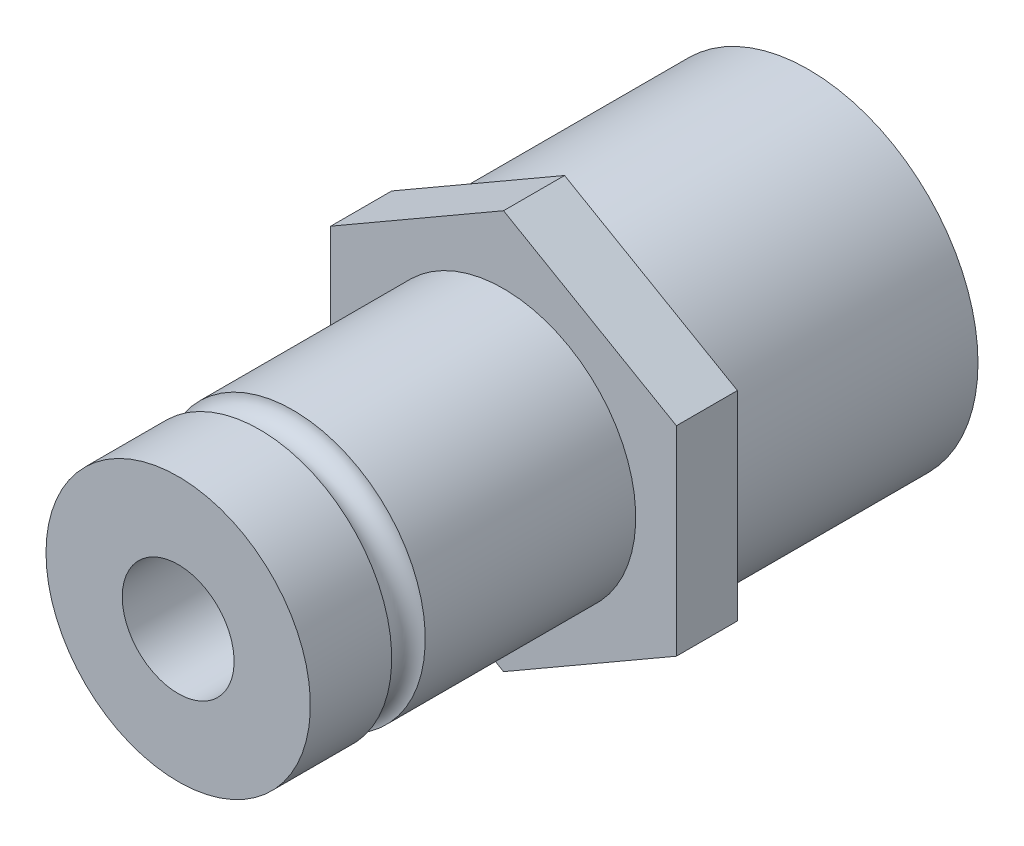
ISO-10303-21;
HEADER;
FILE_DESCRIPTION(('STEP AP214'),'2;1');
FILE_NAME('part.step','',(''),(''),'','','');
FILE_SCHEMA(('AUTOMOTIVE_DESIGN { 1 0 10303 214 1 1 1 1 }'));
ENDSEC;
DATA;
#1=APPLICATION_CONTEXT('core data for automotive mechanical design processes');
#2=APPLICATION_PROTOCOL_DEFINITION('international standard','automotive_design',2000,#1);
#3=PRODUCT_CONTEXT('',#1,'mechanical');
#4=PRODUCT('Part','Part','',(#3));
#5=PRODUCT_RELATED_PRODUCT_CATEGORY('part','',(#4));
#6=PRODUCT_DEFINITION_FORMATION('','',#4);
#7=PRODUCT_DEFINITION_CONTEXT('part definition',#1,'design');
#8=PRODUCT_DEFINITION('design','',#6,#7);
#9=PRODUCT_DEFINITION_SHAPE('','',#8);
#10=(LENGTH_UNIT() NAMED_UNIT(*) SI_UNIT(.MILLI.,.METRE.));
#11=(NAMED_UNIT(*) PLANE_ANGLE_UNIT() SI_UNIT($,.RADIAN.));
#12=(NAMED_UNIT(*) SI_UNIT($,.STERADIAN.) SOLID_ANGLE_UNIT());
#13=UNCERTAINTY_MEASURE_WITH_UNIT(LENGTH_MEASURE(1.E-05),#10,'distance_accuracy_value','');
#14=(GEOMETRIC_REPRESENTATION_CONTEXT(3) GLOBAL_UNCERTAINTY_ASSIGNED_CONTEXT((#13)) GLOBAL_UNIT_ASSIGNED_CONTEXT((#10,
#11,#12)) REPRESENTATION_CONTEXT('',''));
#15=CARTESIAN_POINT('',(0.,0.,0.));
#16=DIRECTION('',(0.,0.,1.));
#17=DIRECTION('',(1.,0.,0.));
#18=AXIS2_PLACEMENT_3D('',#15,#16,#17);
#19=CARTESIAN_POINT('',(0.,0.,12.));
#20=DIRECTION('',(0.,0.,-1.));
#21=DIRECTION('',(-1.,0.,0.));
#22=AXIS2_PLACEMENT_3D('',#19,#20,#21);
#23=CYLINDRICAL_SURFACE('',#22,8.331);
#24=CARTESIAN_POINT('',(0.,0.,12.));
#25=DIRECTION('',(0.,0.,1.));
#26=DIRECTION('',(1.,0.,0.));
#27=AXIS2_PLACEMENT_3D('',#24,#25,#26);
#28=CIRCLE('',#27,8.331);
#29=CARTESIAN_POINT('',(8.331,0.,12.));
#30=VERTEX_POINT('',#29);
#31=EDGE_CURVE('E9',#30,#30,#28,.T.);
#32=ORIENTED_EDGE('',*,*,#31,.F.);
#33=EDGE_LOOP('',(#32));
#34=FACE_BOUND('',#33,.T.);
#35=CARTESIAN_POINT('',(0.,0.,0.));
#36=DIRECTION('',(0.,0.,1.));
#37=DIRECTION('',(1.,0.,0.));
#38=AXIS2_PLACEMENT_3D('',#35,#36,#37);
#39=CIRCLE('',#38,8.331);
#40=CARTESIAN_POINT('',(8.331,0.,0.));
#41=VERTEX_POINT('',#40);
#42=EDGE_CURVE('E18',#41,#41,#39,.T.);
#43=ORIENTED_EDGE('',*,*,#42,.T.);
#44=EDGE_LOOP('',(#43));
#45=FACE_BOUND('',#44,.T.);
#46=ADVANCED_FACE('F15',(#34,#45),#23,.T.);
#47=CARTESIAN_POINT('',(0.,0.,0.));
#48=DIRECTION('',(0.,0.,1.));
#49=DIRECTION('',(1.,0.,0.));
#50=AXIS2_PLACEMENT_3D('',#47,#48,#49);
#51=PLANE('',#50);
#52=CARTESIAN_POINT('',(0.,0.,0.));
#53=DIRECTION('',(0.,0.,-1.));
#54=DIRECTION('',(-1.,0.,0.));
#55=AXIS2_PLACEMENT_3D('',#52,#53,#54);
#56=CIRCLE('',#55,4.);
#57=CARTESIAN_POINT('',(-4.,0.,0.));
#58=VERTEX_POINT('',#57);
#59=EDGE_CURVE('E212',#58,#58,#56,.T.);
#60=ORIENTED_EDGE('',*,*,#59,.F.);
#61=EDGE_LOOP('',(#60));
#62=FACE_BOUND('',#61,.T.);
#63=ORIENTED_EDGE('',*,*,#42,.F.);
#64=EDGE_LOOP('',(#63));
#65=FACE_BOUND('',#64,.T.);
#66=ADVANCED_FACE('F124',(#62,#65),#51,.F.);
#67=CARTESIAN_POINT('',(8.5,4.90747728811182,15.));
#68=DIRECTION('',(-0.5,-0.866025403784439,0.));
#69=DIRECTION('',(0.866025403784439,-0.5,0.));
#70=AXIS2_PLACEMENT_3D('',#67,#68,#69);
#71=PLANE('',#70);
#72=DIRECTION('',(-0.866025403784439,0.5,0.));
#73=VECTOR('',#72,1.);
#74=CARTESIAN_POINT('',(8.5,4.90747728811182,12.));
#75=LINE('',#74,#73);
#76=CARTESIAN_POINT('',(8.5,4.90747728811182,12.));
#77=VERTEX_POINT('',#76);
#78=CARTESIAN_POINT('',(0.,9.81495457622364,12.));
#79=VERTEX_POINT('',#78);
#80=EDGE_CURVE('E100',#77,#79,#75,.T.);
#81=ORIENTED_EDGE('',*,*,#80,.T.);
#82=DIRECTION('',(0.,0.,-1.));
#83=VECTOR('',#82,1.);
#84=CARTESIAN_POINT('',(0.,9.81495457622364,15.));
#85=LINE('',#84,#83);
#86=CARTESIAN_POINT('',(0.,9.81495457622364,15.));
#87=VERTEX_POINT('',#86);
#88=EDGE_CURVE('E118',#87,#79,#85,.T.);
#89=ORIENTED_EDGE('',*,*,#88,.F.);
#90=DIRECTION('',(-0.866025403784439,0.5,0.));
#91=VECTOR('',#90,1.);
#92=CARTESIAN_POINT('',(8.5,4.90747728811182,15.));
#93=LINE('',#92,#91);
#94=CARTESIAN_POINT('',(8.5,4.90747728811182,15.));
#95=VERTEX_POINT('',#94);
#96=EDGE_CURVE('E111',#95,#87,#93,.T.);
#97=ORIENTED_EDGE('',*,*,#96,.F.);
#98=DIRECTION('',(0.,0.,-1.));
#99=VECTOR('',#98,1.);
#100=CARTESIAN_POINT('',(8.5,4.90747728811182,15.));
#101=LINE('',#100,#99);
#102=EDGE_CURVE('E96',#95,#77,#101,.T.);
#103=ORIENTED_EDGE('',*,*,#102,.T.);
#104=EDGE_LOOP('',(#81,#89,#97,#103));
#105=FACE_BOUND('',#104,.T.);
#106=ADVANCED_FACE('F126',(#105),#71,.F.);
#107=CARTESIAN_POINT('',(0.,9.81495457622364,15.));
#108=DIRECTION('',(0.5,-0.866025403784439,0.));
#109=DIRECTION('',(0.866025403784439,0.5,0.));
#110=AXIS2_PLACEMENT_3D('',#107,#108,#109);
#111=PLANE('',#110);
#112=DIRECTION('',(-0.866025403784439,-0.5,0.));
#113=VECTOR('',#112,1.);
#114=CARTESIAN_POINT('',(0.,9.81495457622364,12.));
#115=LINE('',#114,#113);
#116=CARTESIAN_POINT('',(-8.5,4.90747728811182,12.));
#117=VERTEX_POINT('',#116);
#118=EDGE_CURVE('E103',#79,#117,#115,.T.);
#119=ORIENTED_EDGE('',*,*,#118,.T.);
#120=DIRECTION('',(0.,0.,-1.));
#121=VECTOR('',#120,1.);
#122=CARTESIAN_POINT('',(-8.5,4.90747728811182,15.));
#123=LINE('',#122,#121);
#124=CARTESIAN_POINT('',(-8.5,4.90747728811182,15.));
#125=VERTEX_POINT('',#124);
#126=EDGE_CURVE('E115',#125,#117,#123,.T.);
#127=ORIENTED_EDGE('',*,*,#126,.F.);
#128=DIRECTION('',(-0.866025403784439,-0.5,0.));
#129=VECTOR('',#128,1.);
#130=CARTESIAN_POINT('',(0.,9.81495457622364,15.));
#131=LINE('',#130,#129);
#132=EDGE_CURVE('E69',#87,#125,#131,.T.);
#133=ORIENTED_EDGE('',*,*,#132,.F.);
#134=ORIENTED_EDGE('',*,*,#88,.T.);
#135=EDGE_LOOP('',(#119,#127,#133,#134));
#136=FACE_BOUND('',#135,.T.);
#137=ADVANCED_FACE('F134',(#136),#111,.F.);
#138=CARTESIAN_POINT('',(-8.5,4.90747728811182,15.));
#139=DIRECTION('',(1.,0.,0.));
#140=DIRECTION('',(0.,0.,-1.));
#141=AXIS2_PLACEMENT_3D('',#138,#139,#140);
#142=PLANE('',#141);
#143=DIRECTION('',(0.,-1.,0.));
#144=VECTOR('',#143,1.);
#145=CARTESIAN_POINT('',(-8.5,4.90747728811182,12.));
#146=LINE('',#145,#144);
#147=CARTESIAN_POINT('',(-8.5,-4.90747728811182,12.));
#148=VERTEX_POINT('',#147);
#149=EDGE_CURVE('E106',#117,#148,#146,.T.);
#150=ORIENTED_EDGE('',*,*,#149,.T.);
#151=DIRECTION('',(0.,0.,-1.));
#152=VECTOR('',#151,1.);
#153=CARTESIAN_POINT('',(-8.5,-4.90747728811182,15.));
#154=LINE('',#153,#152);
#155=CARTESIAN_POINT('',(-8.5,-4.90747728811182,15.));
#156=VERTEX_POINT('',#155);
#157=EDGE_CURVE('E91',#156,#148,#154,.T.);
#158=ORIENTED_EDGE('',*,*,#157,.F.);
#159=DIRECTION('',(0.,-1.,0.));
#160=VECTOR('',#159,1.);
#161=CARTESIAN_POINT('',(-8.5,4.90747728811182,15.));
#162=LINE('',#161,#160);
#163=EDGE_CURVE('E82',#125,#156,#162,.T.);
#164=ORIENTED_EDGE('',*,*,#163,.F.);
#165=ORIENTED_EDGE('',*,*,#126,.T.);
#166=EDGE_LOOP('',(#150,#158,#164,#165));
#167=FACE_BOUND('',#166,.T.);
#168=ADVANCED_FACE('F142',(#167),#142,.F.);
#169=CARTESIAN_POINT('',(-8.5,-4.90747728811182,15.));
#170=DIRECTION('',(0.5,0.866025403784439,0.));
#171=DIRECTION('',(-0.866025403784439,0.5,0.));
#172=AXIS2_PLACEMENT_3D('',#169,#170,#171);
#173=PLANE('',#172);
#174=DIRECTION('',(0.866025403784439,-0.5,0.));
#175=VECTOR('',#174,1.);
#176=CARTESIAN_POINT('',(-8.5,-4.90747728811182,12.));
#177=LINE('',#176,#175);
#178=CARTESIAN_POINT('',(0.,-9.81495457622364,12.));
#179=VERTEX_POINT('',#178);
#180=EDGE_CURVE('E90',#148,#179,#177,.T.);
#181=ORIENTED_EDGE('',*,*,#180,.T.);
#182=DIRECTION('',(0.,0.,-1.));
#183=VECTOR('',#182,1.);
#184=CARTESIAN_POINT('',(0.,-9.81495457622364,15.));
#185=LINE('',#184,#183);
#186=CARTESIAN_POINT('',(0.,-9.81495457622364,15.));
#187=VERTEX_POINT('',#186);
#188=EDGE_CURVE('E87',#187,#179,#185,.T.);
#189=ORIENTED_EDGE('',*,*,#188,.F.);
#190=DIRECTION('',(0.866025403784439,-0.5,0.));
#191=VECTOR('',#190,1.);
#192=CARTESIAN_POINT('',(-8.5,-4.90747728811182,15.));
#193=LINE('',#192,#191);
#194=EDGE_CURVE('E76',#156,#187,#193,.T.);
#195=ORIENTED_EDGE('',*,*,#194,.F.);
#196=ORIENTED_EDGE('',*,*,#157,.T.);
#197=EDGE_LOOP('',(#181,#189,#195,#196));
#198=FACE_BOUND('',#197,.T.);
#199=ADVANCED_FACE('F88',(#198),#173,.F.);
#200=CARTESIAN_POINT('',(0.,-9.81495457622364,15.));
#201=DIRECTION('',(-0.5,0.866025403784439,0.));
#202=DIRECTION('',(-0.866025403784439,-0.5,0.));
#203=AXIS2_PLACEMENT_3D('',#200,#201,#202);
#204=PLANE('',#203);
#205=DIRECTION('',(0.866025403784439,0.5,0.));
#206=VECTOR('',#205,1.);
#207=CARTESIAN_POINT('',(0.,-9.81495457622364,12.));
#208=LINE('',#207,#206);
#209=CARTESIAN_POINT('',(8.5,-4.90747728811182,12.));
#210=VERTEX_POINT('',#209);
#211=EDGE_CURVE('E54',#179,#210,#208,.T.);
#212=ORIENTED_EDGE('',*,*,#211,.T.);
#213=DIRECTION('',(0.,0.,-1.));
#214=VECTOR('',#213,1.);
#215=CARTESIAN_POINT('',(8.5,-4.90747728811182,15.));
#216=LINE('',#215,#214);
#217=CARTESIAN_POINT('',(8.5,-4.90747728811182,15.));
#218=VERTEX_POINT('',#217);
#219=EDGE_CURVE('E92',#218,#210,#216,.T.);
#220=ORIENTED_EDGE('',*,*,#219,.F.);
#221=DIRECTION('',(0.866025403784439,0.5,0.));
#222=VECTOR('',#221,1.);
#223=CARTESIAN_POINT('',(0.,-9.81495457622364,15.));
#224=LINE('',#223,#222);
#225=EDGE_CURVE('E80',#187,#218,#224,.T.);
#226=ORIENTED_EDGE('',*,*,#225,.F.);
#227=ORIENTED_EDGE('',*,*,#188,.T.);
#228=EDGE_LOOP('',(#212,#220,#226,#227));
#229=FACE_BOUND('',#228,.T.);
#230=ADVANCED_FACE('F94',(#229),#204,.F.);
#231=CARTESIAN_POINT('',(8.5,-4.90747728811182,15.));
#232=DIRECTION('',(-1.,0.,0.));
#233=DIRECTION('',(0.,-1.,0.));
#234=AXIS2_PLACEMENT_3D('',#231,#232,#233);
#235=PLANE('',#234);
#236=DIRECTION('',(0.,1.,0.));
#237=VECTOR('',#236,1.);
#238=CARTESIAN_POINT('',(8.5,-4.90747728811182,12.));
#239=LINE('',#238,#237);
#240=EDGE_CURVE('E60',#210,#77,#239,.T.);
#241=ORIENTED_EDGE('',*,*,#240,.T.);
#242=ORIENTED_EDGE('',*,*,#102,.F.);
#243=DIRECTION('',(0.,1.,0.));
#244=VECTOR('',#243,1.);
#245=CARTESIAN_POINT('',(8.5,-4.90747728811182,15.));
#246=LINE('',#245,#244);
#247=EDGE_CURVE('E31',#218,#95,#246,.T.);
#248=ORIENTED_EDGE('',*,*,#247,.F.);
#249=ORIENTED_EDGE('',*,*,#219,.T.);
#250=EDGE_LOOP('',(#241,#242,#248,#249));
#251=FACE_BOUND('',#250,.T.);
#252=ADVANCED_FACE('F150',(#251),#235,.F.);
#253=CARTESIAN_POINT('',(0.,0.,15.));
#254=DIRECTION('',(0.,0.,1.));
#255=DIRECTION('',(1.,0.,0.));
#256=AXIS2_PLACEMENT_3D('',#253,#254,#255);
#257=PLANE('',#256);
#258=CARTESIAN_POINT('',(0.,0.,15.));
#259=DIRECTION('',(0.,0.,-1.));
#260=DIRECTION('',(-1.,0.,0.));
#261=AXIS2_PLACEMENT_3D('',#258,#259,#260);
#262=CIRCLE('',#261,6.5);
#263=CARTESIAN_POINT('',(-6.5,0.,15.));
#264=VERTEX_POINT('',#263);
#265=EDGE_CURVE('E193',#264,#264,#262,.T.);
#266=ORIENTED_EDGE('',*,*,#265,.T.);
#267=EDGE_LOOP('',(#266));
#268=FACE_BOUND('',#267,.T.);
#269=ORIENTED_EDGE('',*,*,#96,.T.);
#270=ORIENTED_EDGE('',*,*,#132,.T.);
#271=ORIENTED_EDGE('',*,*,#163,.T.);
#272=ORIENTED_EDGE('',*,*,#194,.T.);
#273=ORIENTED_EDGE('',*,*,#225,.T.);
#274=ORIENTED_EDGE('',*,*,#247,.T.);
#275=EDGE_LOOP('',(#269,#270,#271,#272,#273,#274));
#276=FACE_BOUND('',#275,.T.);
#277=ADVANCED_FACE('F78',(#268,#276),#257,.T.);
#278=CARTESIAN_POINT('',(0.,0.,12.));
#279=DIRECTION('',(0.,0.,1.));
#280=DIRECTION('',(1.,0.,0.));
#281=AXIS2_PLACEMENT_3D('',#278,#279,#280);
#282=PLANE('',#281);
#283=ORIENTED_EDGE('',*,*,#31,.T.);
#284=EDGE_LOOP('',(#283));
#285=FACE_BOUND('',#284,.T.);
#286=ORIENTED_EDGE('',*,*,#80,.F.);
#287=ORIENTED_EDGE('',*,*,#240,.F.);
#288=ORIENTED_EDGE('',*,*,#211,.F.);
#289=ORIENTED_EDGE('',*,*,#180,.F.);
#290=ORIENTED_EDGE('',*,*,#149,.F.);
#291=ORIENTED_EDGE('',*,*,#118,.F.);
#292=EDGE_LOOP('',(#286,#287,#288,#289,#290,#291));
#293=FACE_BOUND('',#292,.T.);
#294=ADVANCED_FACE('F153',(#285,#293),#282,.F.);
#295=CARTESIAN_POINT('',(0.,0.,15.));
#296=DIRECTION('',(0.,0.,-1.));
#297=DIRECTION('',(-1.,0.,0.));
#298=AXIS2_PLACEMENT_3D('',#295,#296,#297);
#299=CYLINDRICAL_SURFACE('',#298,4.);
#300=CARTESIAN_POINT('',(0.,0.,15.));
#301=DIRECTION('',(0.,0.,-1.));
#302=DIRECTION('',(-1.,0.,0.));
#303=AXIS2_PLACEMENT_3D('',#300,#301,#302);
#304=CIRCLE('',#303,4.);
#305=CARTESIAN_POINT('',(-4.,0.,15.));
#306=VERTEX_POINT('',#305);
#307=EDGE_CURVE('E104',#306,#306,#304,.T.);
#308=ORIENTED_EDGE('',*,*,#307,.F.);
#309=EDGE_LOOP('',(#308));
#310=FACE_BOUND('',#309,.T.);
#311=ORIENTED_EDGE('',*,*,#59,.T.);
#312=EDGE_LOOP('',(#311));
#313=FACE_BOUND('',#312,.T.);
#314=ADVANCED_FACE('F156',(#310,#313),#299,.F.);
#315=CARTESIAN_POINT('',(2.75,0.,15.));
#316=DIRECTION('',(0.,0.,1.));
#317=DIRECTION('',(1.,0.,0.));
#318=AXIS2_PLACEMENT_3D('',#315,#316,#317);
#319=PLANE('',#318);
#320=CARTESIAN_POINT('',(0.,0.,15.));
#321=DIRECTION('',(0.,0.,-1.));
#322=DIRECTION('',(-1.,0.,0.));
#323=AXIS2_PLACEMENT_3D('',#320,#321,#322);
#324=CIRCLE('',#323,2.75);
#325=CARTESIAN_POINT('',(-2.75,0.,15.));
#326=VERTEX_POINT('',#325);
#327=EDGE_CURVE('E209',#326,#326,#324,.T.);
#328=ORIENTED_EDGE('',*,*,#327,.F.);
#329=EDGE_LOOP('',(#328));
#330=FACE_BOUND('',#329,.T.);
#331=ORIENTED_EDGE('',*,*,#307,.T.);
#332=EDGE_LOOP('',(#331));
#333=FACE_BOUND('',#332,.T.);
#334=ADVANCED_FACE('F163',(#330,#333),#319,.F.);
#335=CARTESIAN_POINT('',(0.,0.,0.));
#336=DIRECTION('',(0.,0.,-1.));
#337=DIRECTION('',(-1.,0.,0.));
#338=AXIS2_PLACEMENT_3D('',#335,#336,#337);
#339=CYLINDRICAL_SURFACE('',#338,2.75);
#340=CARTESIAN_POINT('',(0.,0.,31.));
#341=DIRECTION('',(0.,0.,-1.));
#342=DIRECTION('',(-1.,0.,0.));
#343=AXIS2_PLACEMENT_3D('',#340,#341,#342);
#344=CIRCLE('',#343,2.75);
#345=CARTESIAN_POINT('',(-2.75,0.,31.));
#346=VERTEX_POINT('',#345);
#347=EDGE_CURVE('E206',#346,#346,#344,.T.);
#348=ORIENTED_EDGE('',*,*,#347,.F.);
#349=EDGE_LOOP('',(#348));
#350=FACE_BOUND('',#349,.T.);
#351=ORIENTED_EDGE('',*,*,#327,.T.);
#352=EDGE_LOOP('',(#351));
#353=FACE_BOUND('',#352,.T.);
#354=ADVANCED_FACE('F167',(#350,#353),#339,.F.);
#355=CARTESIAN_POINT('',(6.5,0.,31.));
#356=DIRECTION('',(0.,0.,-1.));
#357=DIRECTION('',(-1.,0.,0.));
#358=AXIS2_PLACEMENT_3D('',#355,#356,#357);
#359=PLANE('',#358);
#360=CARTESIAN_POINT('',(0.,0.,31.));
#361=DIRECTION('',(0.,0.,-1.));
#362=DIRECTION('',(-1.,0.,0.));
#363=AXIS2_PLACEMENT_3D('',#360,#361,#362);
#364=CIRCLE('',#363,6.5);
#365=CARTESIAN_POINT('',(-6.5,0.,31.));
#366=VERTEX_POINT('',#365);
#367=EDGE_CURVE('E200',#366,#366,#364,.T.);
#368=ORIENTED_EDGE('',*,*,#367,.F.);
#369=EDGE_LOOP('',(#368));
#370=FACE_BOUND('',#369,.T.);
#371=ORIENTED_EDGE('',*,*,#347,.T.);
#372=EDGE_LOOP('',(#371));
#373=FACE_BOUND('',#372,.T.);
#374=ADVANCED_FACE('F171',(#370,#373),#359,.F.);
#375=CARTESIAN_POINT('',(0.,0.,0.));
#376=DIRECTION('',(0.,0.,-1.));
#377=DIRECTION('',(-1.,0.,0.));
#378=AXIS2_PLACEMENT_3D('',#375,#376,#377);
#379=CYLINDRICAL_SURFACE('',#378,6.5);
#380=CARTESIAN_POINT('',(0.,0.,27.));
#381=DIRECTION('',(0.,0.,-1.));
#382=DIRECTION('',(-1.,0.,0.));
#383=AXIS2_PLACEMENT_3D('',#380,#381,#382);
#384=CIRCLE('',#383,6.5);
#385=CARTESIAN_POINT('',(-6.5,0.,27.));
#386=VERTEX_POINT('',#385);
#387=EDGE_CURVE('E197',#386,#386,#384,.T.);
#388=ORIENTED_EDGE('',*,*,#387,.F.);
#389=EDGE_LOOP('',(#388));
#390=FACE_BOUND('',#389,.T.);
#391=ORIENTED_EDGE('',*,*,#367,.T.);
#392=EDGE_LOOP('',(#391));
#393=FACE_BOUND('',#392,.T.);
#394=ADVANCED_FACE('F175',(#390,#393),#379,.T.);
#395=CARTESIAN_POINT('',(0.,0.,26.1751700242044));
#396=DIRECTION('',(0.,0.,-1.));
#397=DIRECTION('',(-1.,0.,0.));
#398=AXIS2_PLACEMENT_3D('',#395,#396,#397);
#399=TOROIDAL_SURFACE('',#398,6.55671972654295,0.826777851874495);
#400=CARTESIAN_POINT('',(0.,0.,25.3503400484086));
#401=DIRECTION('',(0.,0.,-1.));
#402=DIRECTION('',(-1.,0.,0.));
#403=AXIS2_PLACEMENT_3D('',#400,#401,#402);
#404=CIRCLE('',#403,6.5);
#405=CARTESIAN_POINT('',(-6.5,0.,25.3503400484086));
#406=VERTEX_POINT('',#405);
#407=EDGE_CURVE('E196',#406,#406,#404,.T.);
#408=ORIENTED_EDGE('',*,*,#407,.F.);
#409=EDGE_LOOP('',(#408));
#410=FACE_BOUND('',#409,.T.);
#411=ORIENTED_EDGE('',*,*,#387,.T.);
#412=EDGE_LOOP('',(#411));
#413=FACE_BOUND('',#412,.T.);
#414=ADVANCED_FACE('F179',(#410,#413),#399,.F.);
#415=CARTESIAN_POINT('',(0.,0.,0.));
#416=DIRECTION('',(0.,0.,-1.));
#417=DIRECTION('',(-1.,0.,0.));
#418=AXIS2_PLACEMENT_3D('',#415,#416,#417);
#419=CYLINDRICAL_SURFACE('',#418,6.5);
#420=ORIENTED_EDGE('',*,*,#265,.F.);
#421=EDGE_LOOP('',(#420));
#422=FACE_BOUND('',#421,.T.);
#423=ORIENTED_EDGE('',*,*,#407,.T.);
#424=EDGE_LOOP('',(#423));
#425=FACE_BOUND('',#424,.T.);
#426=ADVANCED_FACE('F183',(#422,#425),#419,.T.);
#427=CLOSED_SHELL('',(#46,#66,#106,#137,#168,#199,#230,#252,#277,#294,#314,#334,#354,#374,#394,
#414,#426));
#428=MANIFOLD_SOLID_BREP('B1',#427);
#429=ADVANCED_BREP_SHAPE_REPRESENTATION('',(#18,#428),#14);
#430=SHAPE_DEFINITION_REPRESENTATION(#9,#429);
ENDSEC;
END-ISO-10303-21;
